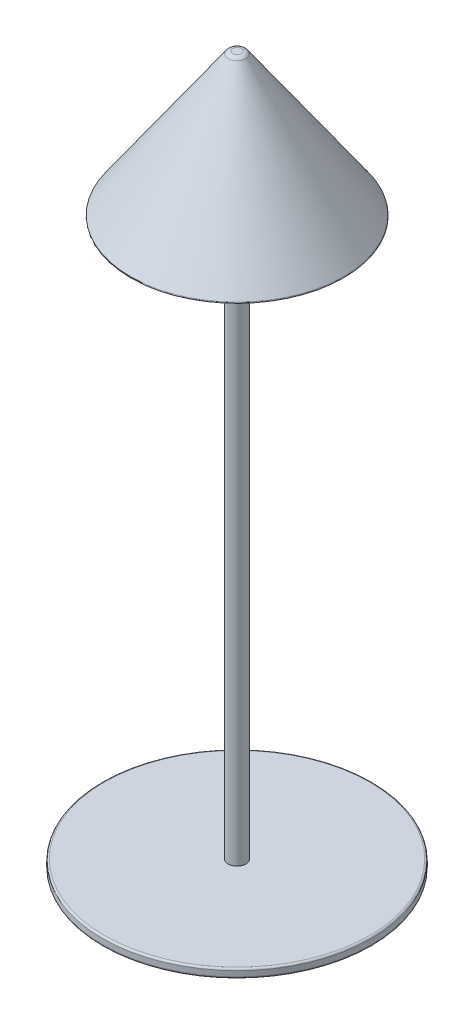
ISO-10303-21;
HEADER;
FILE_DESCRIPTION(('STEP AP214'),'2;1');
FILE_NAME('part.step','',(''),(''),'','','');
FILE_SCHEMA(('AUTOMOTIVE_DESIGN { 1 0 10303 214 1 1 1 1 }'));
ENDSEC;
DATA;
#1=APPLICATION_CONTEXT('core data for automotive mechanical design processes');
#2=APPLICATION_PROTOCOL_DEFINITION('international standard','automotive_design',2000,#1);
#3=PRODUCT_CONTEXT('',#1,'mechanical');
#4=PRODUCT('Part','Part','',(#3));
#5=PRODUCT_RELATED_PRODUCT_CATEGORY('part','',(#4));
#6=PRODUCT_DEFINITION_FORMATION('','',#4);
#7=PRODUCT_DEFINITION_CONTEXT('part definition',#1,'design');
#8=PRODUCT_DEFINITION('design','',#6,#7);
#9=PRODUCT_DEFINITION_SHAPE('','',#8);
#10=(LENGTH_UNIT() NAMED_UNIT(*) SI_UNIT(.MILLI.,.METRE.));
#11=(NAMED_UNIT(*) PLANE_ANGLE_UNIT() SI_UNIT($,.RADIAN.));
#12=(NAMED_UNIT(*) SI_UNIT($,.STERADIAN.) SOLID_ANGLE_UNIT());
#13=UNCERTAINTY_MEASURE_WITH_UNIT(LENGTH_MEASURE(1.E-05),#10,'distance_accuracy_value','');
#14=(GEOMETRIC_REPRESENTATION_CONTEXT(3) GLOBAL_UNCERTAINTY_ASSIGNED_CONTEXT((#13)) GLOBAL_UNIT_ASSIGNED_CONTEXT((#10,
#11,#12)) REPRESENTATION_CONTEXT('',''));
#15=CARTESIAN_POINT('',(0.,0.,0.));
#16=DIRECTION('',(0.,0.,1.));
#17=DIRECTION('',(1.,0.,0.));
#18=AXIS2_PLACEMENT_3D('',#15,#16,#17);
#19=CARTESIAN_POINT('',(-14.1843345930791,258.158097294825,320.));
#20=DIRECTION('',(0.,-1.,0.));
#21=DIRECTION('',(0.998534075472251,0.,-0.0541267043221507));
#22=AXIS2_PLACEMENT_3D('',#19,#20,#21);
#23=PLANE('',#22);
#24=CARTESIAN_POINT('',(-14.1843345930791,258.158097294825,320.));
#25=DIRECTION('',(0.,-1.,0.));
#26=DIRECTION('',(0.998534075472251,0.,-0.0541267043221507));
#27=AXIS2_PLACEMENT_3D('',#24,#25,#26);
#28=CIRCLE('',#27,2.4380333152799);
#29=CARTESIAN_POINT('',(-11.7498752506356,258.158097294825,319.868037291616));
#30=VERTEX_POINT('',#29);
#31=EDGE_CURVE('P0_E30',#30,#30,#28,.F.);
#32=ORIENTED_EDGE('',*,*,#31,.T.);
#33=EDGE_LOOP('',(#32));
#34=FACE_BOUND('',#33,.T.);
#35=ADVANCED_FACE('P0_F15',(#34),#23,.F.);
#36=CARTESIAN_POINT('',(-14.1843345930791,178.158097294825,320.));
#37=DIRECTION('',(0.,-1.,0.));
#38=DIRECTION('',(0.998534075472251,0.,-0.0541267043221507));
#39=AXIS2_PLACEMENT_3D('',#36,#37,#38);
#40=CONICAL_SURFACE('',#39,60.,0.610725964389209);
#41=CARTESIAN_POINT('',(-14.1843345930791,178.944828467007,320.));
#42=DIRECTION('',(0.,1.,0.));
#43=DIRECTION('',(-0.998534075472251,0.,0.0541267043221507));
#44=AXIS2_PLACEMENT_3D('',#41,#42,#43);
#45=CIRCLE('',#44,59.4492881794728);
#46=CARTESIAN_POINT('',(45.1778054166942,178.944828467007,316.782205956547));
#47=VERTEX_POINT('',#46);
#48=EDGE_CURVE('P0_E22',#47,#47,#45,.T.);
#49=CARTESIAN_POINT('',(-14.1843345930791,256.878484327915,320.));
#50=DIRECTION('',(0.,1.,0.));
#51=DIRECTION('',(-0.998534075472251,0.,0.0541267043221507));
#52=AXIS2_PLACEMENT_3D('',#49,#50,#51);
#53=CIRCLE('',#52,4.89572907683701);
#54=CARTESIAN_POINT('',(-9.29578228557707,256.878484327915,319.735010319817));
#55=VERTEX_POINT('',#54);
#56=EDGE_CURVE('P0_E26',#55,#55,#53,.F.);
#57=CARTESIAN_POINT('',(45.1778054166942,178.944828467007,316.782205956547));
#58=CARTESIAN_POINT('',(44.6103722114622,179.756637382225,316.812964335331));
#59=CARTESIAN_POINT('',(44.0429390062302,180.568446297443,316.843722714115));
#60=CARTESIAN_POINT('',(42.9080725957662,182.192064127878,316.905239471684));
#61=CARTESIAN_POINT('',(42.3406393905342,183.003873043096,316.935997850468));
#62=CARTESIAN_POINT('',(41.2057729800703,184.627490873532,316.997514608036));
#63=CARTESIAN_POINT('',(40.6383397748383,185.439299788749,317.02827298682));
#64=CARTESIAN_POINT('',(39.5034733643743,187.062917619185,317.089789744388));
#65=CARTESIAN_POINT('',(38.9360401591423,187.874726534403,317.120548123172));
#66=CARTESIAN_POINT('',(37.8011737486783,189.498344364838,317.18206488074));
#67=CARTESIAN_POINT('',(37.2337405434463,190.310153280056,317.212823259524));
#68=CARTESIAN_POINT('',(36.0988741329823,191.933771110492,317.274340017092));
#69=CARTESIAN_POINT('',(35.5314409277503,192.74558002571,317.305098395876));
#70=CARTESIAN_POINT('',(34.3965745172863,194.369197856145,317.366615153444));
#71=CARTESIAN_POINT('',(33.8291413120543,195.181006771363,317.397373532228));
#72=CARTESIAN_POINT('',(32.6942749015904,196.804624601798,317.458890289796));
#73=CARTESIAN_POINT('',(32.1268416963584,197.616433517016,317.489648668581));
#74=CARTESIAN_POINT('',(30.9919752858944,199.240051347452,317.551165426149));
#75=CARTESIAN_POINT('',(30.4245420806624,200.05186026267,317.581923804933));
#76=CARTESIAN_POINT('',(29.2896756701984,201.675478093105,317.643440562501));
#77=CARTESIAN_POINT('',(28.7222424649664,202.487287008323,317.674198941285));
#78=CARTESIAN_POINT('',(27.5873760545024,204.110904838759,317.735715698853));
#79=CARTESIAN_POINT('',(27.0199428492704,204.922713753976,317.766474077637));
#80=CARTESIAN_POINT('',(25.8850764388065,206.546331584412,317.827990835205));
#81=CARTESIAN_POINT('',(25.3176432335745,207.35814049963,317.858749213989));
#82=CARTESIAN_POINT('',(24.1827768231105,208.981758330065,317.920265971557));
#83=CARTESIAN_POINT('',(23.6153436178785,209.793567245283,317.951024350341));
#84=CARTESIAN_POINT('',(22.4804772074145,211.417185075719,318.01254110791));
#85=CARTESIAN_POINT('',(21.9130440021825,212.228993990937,318.043299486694));
#86=CARTESIAN_POINT('',(20.7781775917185,213.852611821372,318.104816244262));
#87=CARTESIAN_POINT('',(20.2107443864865,214.66442073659,318.135574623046));
#88=CARTESIAN_POINT('',(19.0758779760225,216.288038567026,318.197091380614));
#89=CARTESIAN_POINT('',(18.5084447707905,217.099847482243,318.227849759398));
#90=CARTESIAN_POINT('',(17.3735783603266,218.723465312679,318.289366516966));
#91=CARTESIAN_POINT('',(16.8061451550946,219.535274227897,318.32012489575));
#92=CARTESIAN_POINT('',(15.6712787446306,221.158892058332,318.381641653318));
#93=CARTESIAN_POINT('',(15.1038455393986,221.97070097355,318.412400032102));
#94=CARTESIAN_POINT('',(13.9689791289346,223.594318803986,318.47391678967));
#95=CARTESIAN_POINT('',(13.4015459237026,224.406127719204,318.504675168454));
#96=CARTESIAN_POINT('',(12.2666795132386,226.029745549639,318.566191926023));
#97=CARTESIAN_POINT('',(11.6992463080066,226.841554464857,318.596950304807));
#98=CARTESIAN_POINT('',(10.5643798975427,228.465172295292,318.658467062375));
#99=CARTESIAN_POINT('',(9.99694669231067,229.27698121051,318.689225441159));
#100=CARTESIAN_POINT('',(8.86208028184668,230.900599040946,318.750742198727));
#101=CARTESIAN_POINT('',(8.29464707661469,231.712407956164,318.781500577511));
#102=CARTESIAN_POINT('',(7.1597806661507,233.336025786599,318.843017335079));
#103=CARTESIAN_POINT('',(6.59234746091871,234.147834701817,318.873775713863));
#104=CARTESIAN_POINT('',(5.45748105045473,235.771452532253,318.935292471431));
#105=CARTESIAN_POINT('',(4.89004784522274,236.58326144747,318.966050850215));
#106=CARTESIAN_POINT('',(3.75518143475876,238.206879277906,319.027567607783));
#107=CARTESIAN_POINT('',(3.18774822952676,239.018688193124,319.058325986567));
#108=CARTESIAN_POINT('',(2.05288181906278,240.642306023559,319.119842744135));
#109=CARTESIAN_POINT('',(1.48544861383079,241.454114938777,319.15060112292));
#110=CARTESIAN_POINT('',(0.350582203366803,243.077732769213,319.212117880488));
#111=CARTESIAN_POINT('',(-0.216851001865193,243.889541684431,319.242876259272));
#112=CARTESIAN_POINT('',(-1.35171741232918,245.513159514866,319.30439301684));
#113=CARTESIAN_POINT('',(-1.91915061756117,246.324968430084,319.335151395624));
#114=CARTESIAN_POINT('',(-3.05401702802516,247.94858626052,319.396668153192));
#115=CARTESIAN_POINT('',(-3.62145023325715,248.760395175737,319.427426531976));
#116=CARTESIAN_POINT('',(-4.75631664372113,250.384013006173,319.488943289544));
#117=CARTESIAN_POINT('',(-5.32374984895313,251.195821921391,319.519701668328));
#118=CARTESIAN_POINT('',(-6.45861625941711,252.819439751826,319.581218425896));
#119=CARTESIAN_POINT('',(-7.02604946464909,253.631248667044,319.61197680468));
#120=CARTESIAN_POINT('',(-8.16091587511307,255.25486649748,319.673493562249));
#121=CARTESIAN_POINT('',(-8.72834908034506,256.066675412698,319.704251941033));
#122=CARTESIAN_POINT('',(-9.29578228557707,256.878484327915,319.735010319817));
#123=B_SPLINE_CURVE_WITH_KNOTS('',3,(#57,#58,#59,#60,#61,#62,#63,#64,#65,#66,#67,#68,#69,#70,
#71,#72,#73,#74,#75,#76,#77,#78,#79,#80,#81,#82,#83,#84,#85,#86,#87,#88,#89,#90,#91,#92,#93,#94,
#95,#96,#97,#98,#99,#100,#101,#102,#103,#104,#105,#106,#107,#108,#109,#110,#111,#112,#113,#114,
#115,#116,#117,#118,#119,#120,#121,#122),.UNSPECIFIED.,.F.,.F.,(4,2,2,2,2,2,2,2,2,2,2,2,2,2,2,2,
2,2,2,2,2,2,2,2,2,2,2,2,2,2,2,2,4),(0.,2.97281720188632,5.94563440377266,8.918451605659,
11.8912688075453,14.8640860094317,17.836903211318,20.8097204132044,23.7825376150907,
26.755354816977,29.7281720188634,32.7009892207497,35.6738064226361,38.6466236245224,
41.6194408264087,44.5922580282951,47.5650752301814,50.5378924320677,53.5107096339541,
56.4835268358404,59.4563440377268,62.4291612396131,65.4019784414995,68.3747956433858,
71.3476128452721,74.3204300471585,77.2932472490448,80.2660644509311,83.2388816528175,
86.2116988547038,89.1845160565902,92.1573332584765,95.1301504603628),.UNSPECIFIED.);
#124=EDGE_CURVE('P0_BSEAM56',#47,#55,#123,.T.);
#125=ORIENTED_EDGE('',*,*,#48,.T.);
#126=ORIENTED_EDGE('',*,*,#56,.T.);
#127=ORIENTED_EDGE('',*,*,#124,.T.);
#128=ORIENTED_EDGE('',*,*,#124,.F.);
#129=EDGE_LOOP('',(#125,#127,#126,#128));
#130=FACE_BOUND('',#129,.T.);
#131=ADVANCED_FACE('P0_F56',(#130),#40,.T.);
#132=CARTESIAN_POINT('',(-17.4319368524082,178.158097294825,260.087955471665));
#133=DIRECTION('',(0.,1.,0.));
#134=DIRECTION('',(-0.998534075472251,0.,0.0541267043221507));
#135=AXIS2_PLACEMENT_3D('',#132,#133,#134);
#136=PLANE('',#135);
#137=CARTESIAN_POINT('',(-14.1843345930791,178.158097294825,320.));
#138=DIRECTION('',(0.,1.,0.));
#139=DIRECTION('',(-0.998534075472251,0.,0.0541267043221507));
#140=AXIS2_PLACEMENT_3D('',#137,#138,#139);
#141=CIRCLE('',#140,59.0396722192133);
#142=CARTESIAN_POINT('',(-73.137459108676,178.158097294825,323.195622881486));
#143=VERTEX_POINT('',#142);
#144=EDGE_CURVE('P0_E10',#143,#143,#141,.F.);
#145=ORIENTED_EDGE('',*,*,#144,.T.);
#146=EDGE_LOOP('',(#145));
#147=FACE_BOUND('',#146,.T.);
#148=CARTESIAN_POINT('',(-14.1843345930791,178.158097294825,320.));
#149=DIRECTION('',(0.,1.,0.));
#150=DIRECTION('',(-0.998534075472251,0.,0.0541267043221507));
#151=AXIS2_PLACEMENT_3D('',#148,#149,#150);
#152=CIRCLE('',#151,57.5586888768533);
#153=CARTESIAN_POINT('',(43.2899775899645,178.158097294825,316.884537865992));
#154=VERTEX_POINT('',#153);
#155=EDGE_CURVE('P0_E36',#154,#154,#152,.T.);
#156=ORIENTED_EDGE('',*,*,#155,.T.);
#157=EDGE_LOOP('',(#156));
#158=FACE_BOUND('',#157,.T.);
#159=ADVANCED_FACE('P0_F47',(#147,#158),#136,.F.);
#160=CARTESIAN_POINT('',(-14.1843345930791,256.158097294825,320.));
#161=DIRECTION('',(0.,-1.,0.));
#162=DIRECTION('',(0.998534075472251,0.,-0.0541267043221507));
#163=AXIS2_PLACEMENT_3D('',#160,#161,#162);
#164=PLANE('',#163);
#165=CARTESIAN_POINT('',(-14.1843345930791,256.158097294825,320.));
#166=DIRECTION('',(0.,-1.,0.));
#167=DIRECTION('',(0.998534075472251,0.,-0.0541267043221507));
#168=AXIS2_PLACEMENT_3D('',#165,#166,#167);
#169=CIRCLE('',#168,2.95868887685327);
#170=CARTESIAN_POINT('',(-11.2299829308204,256.158097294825,319.839855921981));
#171=VERTEX_POINT('',#170);
#172=EDGE_CURVE('P0_E35',#171,#171,#169,.F.);
#173=ORIENTED_EDGE('',*,*,#172,.F.);
#174=EDGE_LOOP('',(#173));
#175=FACE_BOUND('',#174,.T.);
#176=ADVANCED_FACE('P0_F45',(#175),#164,.T.);
#177=CARTESIAN_POINT('',(-14.1843345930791,177.011172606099,320.));
#178=DIRECTION('',(0.,-1.,0.));
#179=DIRECTION('',(0.998534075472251,0.,-0.0541267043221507));
#180=AXIS2_PLACEMENT_3D('',#177,#178,#179);
#181=CONICAL_SURFACE('',#180,58.3615361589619,0.610725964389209);
#182=CARTESIAN_POINT('',(-11.2299829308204,256.158097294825,319.839855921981));
#183=CARTESIAN_POINT('',(-10.6620666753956,255.345597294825,319.809071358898));
#184=CARTESIAN_POINT('',(-10.0941504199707,254.533097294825,319.778286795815));
#185=CARTESIAN_POINT('',(-8.95831790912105,252.908097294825,319.716717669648));
#186=CARTESIAN_POINT('',(-8.3904016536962,252.095597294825,319.685933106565));
#187=CARTESIAN_POINT('',(-7.25456914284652,250.470597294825,319.624363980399));
#188=CARTESIAN_POINT('',(-6.68665288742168,249.658097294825,319.593579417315));
#189=CARTESIAN_POINT('',(-5.55082037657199,248.033097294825,319.532010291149));
#190=CARTESIAN_POINT('',(-4.98290412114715,247.220597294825,319.501225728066));
#191=CARTESIAN_POINT('',(-3.84707161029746,245.595597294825,319.439656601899));
#192=CARTESIAN_POINT('',(-3.27915535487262,244.783097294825,319.408872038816));
#193=CARTESIAN_POINT('',(-2.14332284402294,243.158097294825,319.34730291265));
#194=CARTESIAN_POINT('',(-1.57540658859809,242.345597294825,319.316518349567));
#195=CARTESIAN_POINT('',(-0.439574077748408,240.720597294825,319.2549492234));
#196=CARTESIAN_POINT('',(0.128342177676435,239.908097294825,319.224164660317));
#197=CARTESIAN_POINT('',(1.26417468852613,238.283097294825,319.16259553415));
#198=CARTESIAN_POINT('',(1.83209094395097,237.470597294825,319.131810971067));
#199=CARTESIAN_POINT('',(2.96792345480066,235.845597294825,319.070241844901));
#200=CARTESIAN_POINT('',(3.5358397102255,235.033097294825,319.039457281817));
#201=CARTESIAN_POINT('',(4.67167222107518,233.408097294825,318.977888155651));
#202=CARTESIAN_POINT('',(5.23958847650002,232.595597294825,318.947103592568));
#203=CARTESIAN_POINT('',(6.37542098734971,230.970597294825,318.885534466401));
#204=CARTESIAN_POINT('',(6.94333724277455,230.158097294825,318.854749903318));
#205=CARTESIAN_POINT('',(8.07916975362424,228.533097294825,318.793180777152));
#206=CARTESIAN_POINT('',(8.64708600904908,227.720597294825,318.762396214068));
#207=CARTESIAN_POINT('',(9.78291851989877,226.095597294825,318.700827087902));
#208=CARTESIAN_POINT('',(10.3508347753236,225.283097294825,318.670042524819));
#209=CARTESIAN_POINT('',(11.4866672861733,223.658097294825,318.608473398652));
#210=CARTESIAN_POINT('',(12.0545835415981,222.845597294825,318.577688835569));
#211=CARTESIAN_POINT('',(13.1904160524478,221.220597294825,318.516119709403));
#212=CARTESIAN_POINT('',(13.7583323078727,220.408097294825,318.485335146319));
#213=CARTESIAN_POINT('',(14.8941648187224,218.783097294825,318.423766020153));
#214=CARTESIAN_POINT('',(15.4620810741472,217.970597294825,318.39298145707));
#215=CARTESIAN_POINT('',(16.5979135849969,216.345597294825,318.331412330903));
#216=CARTESIAN_POINT('',(17.1658298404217,215.533097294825,318.30062776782));
#217=CARTESIAN_POINT('',(18.3016623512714,213.908097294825,318.239058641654));
#218=CARTESIAN_POINT('',(18.8695786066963,213.095597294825,318.20827407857));
#219=CARTESIAN_POINT('',(20.0054111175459,211.470597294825,318.146704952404));
#220=CARTESIAN_POINT('',(20.5733273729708,210.658097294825,318.115920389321));
#221=CARTESIAN_POINT('',(21.7091598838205,209.033097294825,318.054351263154));
#222=CARTESIAN_POINT('',(22.2770761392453,208.220597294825,318.023566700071));
#223=CARTESIAN_POINT('',(23.412908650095,206.595597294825,317.961997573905));
#224=CARTESIAN_POINT('',(23.9808249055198,205.783097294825,317.931213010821));
#225=CARTESIAN_POINT('',(25.1166574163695,204.158097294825,317.869643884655));
#226=CARTESIAN_POINT('',(25.6845736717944,203.345597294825,317.838859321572));
#227=CARTESIAN_POINT('',(26.8204061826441,201.720597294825,317.777290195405));
#228=CARTESIAN_POINT('',(27.3883224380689,200.908097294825,317.746505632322));
#229=CARTESIAN_POINT('',(28.5241549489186,199.283097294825,317.684936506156));
#230=CARTESIAN_POINT('',(29.0920712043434,198.470597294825,317.654151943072));
#231=CARTESIAN_POINT('',(30.2279037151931,196.845597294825,317.592582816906));
#232=CARTESIAN_POINT('',(30.795819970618,196.033097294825,317.561798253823));
#233=CARTESIAN_POINT('',(31.9316524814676,194.408097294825,317.500229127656));
#234=CARTESIAN_POINT('',(32.4995687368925,193.595597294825,317.469444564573));
#235=CARTESIAN_POINT('',(33.6354012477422,191.970597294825,317.407875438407));
#236=CARTESIAN_POINT('',(34.203317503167,191.158097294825,317.377090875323));
#237=CARTESIAN_POINT('',(35.3391500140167,189.533097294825,317.315521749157));
#238=CARTESIAN_POINT('',(35.9070662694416,188.720597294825,317.284737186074));
#239=CARTESIAN_POINT('',(37.0428987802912,187.095597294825,317.223168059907));
#240=CARTESIAN_POINT('',(37.6108150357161,186.283097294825,317.192383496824));
#241=CARTESIAN_POINT('',(38.7466475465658,184.658097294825,317.130814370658));
#242=CARTESIAN_POINT('',(39.3145638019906,183.845597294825,317.100029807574));
#243=CARTESIAN_POINT('',(40.4503963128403,182.220597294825,317.038460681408));
#244=CARTESIAN_POINT('',(41.0183125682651,181.408097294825,317.007676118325));
#245=CARTESIAN_POINT('',(42.1541450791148,179.783097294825,316.946106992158));
#246=CARTESIAN_POINT('',(42.7220613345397,178.970597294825,316.915322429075));
#247=CARTESIAN_POINT('',(43.2899775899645,178.158097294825,316.884537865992));
#248=B_SPLINE_CURVE_WITH_KNOTS('',3,(#182,#183,#184,#185,#186,#187,#188,#189,#190,#191,#192,
#193,#194,#195,#196,#197,#198,#199,#200,#201,#202,#203,#204,#205,#206,#207,#208,#209,#210,#211,
#212,#213,#214,#215,#216,#217,#218,#219,#220,#221,#222,#223,#224,#225,#226,#227,#228,#229,#230,
#231,#232,#233,#234,#235,#236,#237,#238,#239,#240,#241,#242,#243,#244,#245,#246,#247),
.UNSPECIFIED.,.F.,.F.,(4,2,2,2,2,2,2,2,2,2,2,2,2,2,2,2,2,2,2,2,2,2,2,2,2,2,2,2,2,2,2,2,4),(0.,
2.97534793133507,5.95069586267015,8.92604379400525,11.9013917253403,14.8767396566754,
17.8520875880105,20.8274355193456,23.8027834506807,26.7781313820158,29.7534793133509,
32.728827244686,35.7041751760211,38.6795231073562,41.6548710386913,44.6302189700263,
47.6055669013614,50.5809148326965,53.5562627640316,56.5316106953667,59.5069586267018,
62.4823065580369,65.457654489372,68.4330024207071,71.4083503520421,74.3836982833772,
77.3590462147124,80.3343941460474,83.3097420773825,86.2850900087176,89.2604379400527,
92.2357858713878,95.2111338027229),.UNSPECIFIED.);
#249=EDGE_CURVE('P0_BSEAM42',#171,#154,#248,.T.);
#250=ORIENTED_EDGE('',*,*,#172,.T.);
#251=ORIENTED_EDGE('',*,*,#155,.F.);
#252=ORIENTED_EDGE('',*,*,#249,.T.);
#253=ORIENTED_EDGE('',*,*,#249,.F.);
#254=EDGE_LOOP('',(#250,#252,#251,#253));
#255=FACE_BOUND('',#254,.T.);
#256=ADVANCED_FACE('P0_F42',(#255),#181,.F.);
#257=CARTESIAN_POINT('',(-14.1843345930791,255.158097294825,320.));
#258=DIRECTION('',(0.,-1.,0.));
#259=DIRECTION('',(0.998534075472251,0.,-0.0541267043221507));
#260=AXIS2_PLACEMENT_3D('',#257,#258,#259);
#261=DEGENERATE_TOROIDAL_SURFACE('',#260,2.4380333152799,3.,.T.);
#262=ORIENTED_EDGE('',*,*,#56,.F.);
#263=EDGE_LOOP('',(#262));
#264=FACE_BOUND('',#263,.T.);
#265=ORIENTED_EDGE('',*,*,#31,.F.);
#266=EDGE_LOOP('',(#265));
#267=FACE_BOUND('',#266,.T.);
#268=ADVANCED_FACE('P0_F54',(#264,#267),#261,.T.);
#269=CARTESIAN_POINT('',(-14.1843345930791,178.658097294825,320.));
#270=DIRECTION('',(0.,1.,0.));
#271=DIRECTION('',(-0.998534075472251,0.,0.0541267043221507));
#272=AXIS2_PLACEMENT_3D('',#269,#270,#271);
#273=TOROIDAL_SURFACE('',#272,59.0396722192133,0.5);
#274=ORIENTED_EDGE('',*,*,#144,.F.);
#275=EDGE_LOOP('',(#274));
#276=FACE_BOUND('',#275,.T.);
#277=ORIENTED_EDGE('',*,*,#48,.F.);
#278=EDGE_LOOP('',(#277));
#279=FACE_BOUND('',#278,.T.);
#280=ADVANCED_FACE('P0_F17',(#276,#279),#273,.T.);
#281=CLOSED_SHELL('',(#35,#131,#159,#176,#256,#268,#280));
#282=MANIFOLD_SOLID_BREP('P0_B1',#281);
#283=CARTESIAN_POINT('',(-14.1843345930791,188.658097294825,320.));
#284=DIRECTION('',(0.,1.,0.));
#285=DIRECTION('',(0.0541267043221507,0.,0.998534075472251));
#286=AXIS2_PLACEMENT_3D('',#283,#284,#285);
#287=PLANE('',#286);
#288=CARTESIAN_POINT('',(-14.1843345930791,188.658097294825,320.));
#289=DIRECTION('',(0.,1.,0.));
#290=DIRECTION('',(0.0541267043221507,0.,0.998534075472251));
#291=AXIS2_PLACEMENT_3D('',#288,#289,#290);
#292=CIRCLE('',#291,50.3735945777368);
#293=CARTESIAN_POINT('',(-11.4577779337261,188.658097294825,370.299750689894));
#294=VERTEX_POINT('',#293);
#295=EDGE_CURVE('P1_E10',#294,#294,#292,.T.);
#296=ORIENTED_EDGE('',*,*,#295,.T.);
#297=EDGE_LOOP('',(#296));
#298=FACE_BOUND('',#297,.T.);
#299=ADVANCED_FACE('P1_F15',(#298),#287,.T.);
#300=CARTESIAN_POINT('',(-14.1843345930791,188.658097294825,320.));
#301=DIRECTION('',(0.,-1.,0.));
#302=DIRECTION('',(-0.0541267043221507,0.,-0.998534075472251));
#303=AXIS2_PLACEMENT_3D('',#300,#301,#302);
#304=CONICAL_SURFACE('',#303,50.3735945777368,0.718829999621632);
#305=CARTESIAN_POINT('',(-14.1843345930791,188.158097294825,320.));
#306=DIRECTION('',(0.,1.,0.));
#307=DIRECTION('',(0.0541267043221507,0.,0.998534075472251));
#308=AXIS2_PLACEMENT_3D('',#305,#306,#307);
#309=CIRCLE('',#308,50.8110945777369);
#310=CARTESIAN_POINT('',(-11.4340975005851,188.158097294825,370.736609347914));
#311=VERTEX_POINT('',#310);
#312=EDGE_CURVE('P1_E21',#311,#311,#309,.T.);
#313=ORIENTED_EDGE('',*,*,#312,.T.);
#314=EDGE_LOOP('',(#313));
#315=FACE_BOUND('',#314,.T.);
#316=ORIENTED_EDGE('',*,*,#295,.F.);
#317=EDGE_LOOP('',(#316));
#318=FACE_BOUND('',#317,.T.);
#319=ADVANCED_FACE('P1_F27',(#315,#318),#304,.T.);
#320=CARTESIAN_POINT('',(-14.1843345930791,188.158097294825,320.));
#321=DIRECTION('',(0.,-1.,0.));
#322=DIRECTION('',(-0.0541267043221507,0.,-0.998534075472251));
#323=AXIS2_PLACEMENT_3D('',#320,#321,#322);
#324=PLANE('',#323);
#325=ORIENTED_EDGE('',*,*,#312,.F.);
#326=EDGE_LOOP('',(#325));
#327=FACE_BOUND('',#326,.T.);
#328=ADVANCED_FACE('P1_F30',(#327),#324,.T.);
#329=CLOSED_SHELL('',(#299,#319,#328));
#330=MANIFOLD_SOLID_BREP('P1_B1',#329);
#331=CARTESIAN_POINT('',(-14.1843345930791,168.158097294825,320.));
#332=DIRECTION('',(0.,1.,0.));
#333=DIRECTION('',(-0.998534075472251,0.,0.0541267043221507));
#334=AXIS2_PLACEMENT_3D('',#331,#332,#333);
#335=CYLINDRICAL_SURFACE('',#334,5.);
#336=CARTESIAN_POINT('',(-14.1843345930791,168.158097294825,320.));
#337=DIRECTION('',(0.,-1.,0.));
#338=DIRECTION('',(0.998534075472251,0.,-0.0541267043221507));
#339=AXIS2_PLACEMENT_3D('',#336,#337,#338);
#340=CIRCLE('',#339,5.);
#341=CARTESIAN_POINT('',(-9.19166421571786,168.158097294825,319.729366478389));
#342=VERTEX_POINT('',#341);
#343=EDGE_CURVE('P2_E9',#342,#342,#340,.T.);
#344=ORIENTED_EDGE('',*,*,#343,.F.);
#345=EDGE_LOOP('',(#344));
#346=FACE_BOUND('',#345,.T.);
#347=CARTESIAN_POINT('',(-14.1843345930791,188.158097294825,320.));
#348=DIRECTION('',(0.,-1.,0.));
#349=DIRECTION('',(0.998534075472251,0.,-0.0541267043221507));
#350=AXIS2_PLACEMENT_3D('',#347,#348,#349);
#351=CIRCLE('',#350,5.);
#352=CARTESIAN_POINT('',(-9.19166421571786,188.158097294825,319.729366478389));
#353=VERTEX_POINT('',#352);
#354=EDGE_CURVE('P2_E17',#353,#353,#351,.T.);
#355=ORIENTED_EDGE('',*,*,#354,.T.);
#356=EDGE_LOOP('',(#355));
#357=FACE_BOUND('',#356,.T.);
#358=ADVANCED_FACE('P2_F14',(#346,#357),#335,.T.);
#359=CARTESIAN_POINT('',(-14.1843345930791,168.158097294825,320.));
#360=DIRECTION('',(0.,-1.,0.));
#361=DIRECTION('',(0.998534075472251,0.,-0.0541267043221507));
#362=AXIS2_PLACEMENT_3D('',#359,#360,#361);
#363=PLANE('',#362);
#364=CARTESIAN_POINT('',(-14.1843345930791,168.158097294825,320.));
#365=DIRECTION('',(0.,-1.,0.));
#366=DIRECTION('',(0.998534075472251,0.,-0.0541267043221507));
#367=AXIS2_PLACEMENT_3D('',#364,#365,#366);
#368=CIRCLE('',#367,4.);
#369=CARTESIAN_POINT('',(-10.1901982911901,168.158097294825,319.783493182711));
#370=VERTEX_POINT('',#369);
#371=EDGE_CURVE('P2_E26',#370,#370,#368,.T.);
#372=ORIENTED_EDGE('',*,*,#371,.F.);
#373=EDGE_LOOP('',(#372));
#374=FACE_BOUND('',#373,.T.);
#375=ORIENTED_EDGE('',*,*,#343,.T.);
#376=EDGE_LOOP('',(#375));
#377=FACE_BOUND('',#376,.T.);
#378=ADVANCED_FACE('P2_F41',(#374,#377),#363,.T.);
#379=CARTESIAN_POINT('',(-14.1843345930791,188.158097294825,320.));
#380=DIRECTION('',(0.,-1.,0.));
#381=DIRECTION('',(0.998534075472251,0.,-0.0541267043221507));
#382=AXIS2_PLACEMENT_3D('',#379,#380,#381);
#383=PLANE('',#382);
#384=ORIENTED_EDGE('',*,*,#354,.F.);
#385=EDGE_LOOP('',(#384));
#386=FACE_BOUND('',#385,.T.);
#387=ADVANCED_FACE('P2_F37',(#386),#383,.F.);
#388=CARTESIAN_POINT('',(-14.1843345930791,178.158097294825,320.));
#389=DIRECTION('',(0.,-1.,0.));
#390=DIRECTION('',(0.998534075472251,0.,-0.0541267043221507));
#391=AXIS2_PLACEMENT_3D('',#388,#389,#390);
#392=CYLINDRICAL_SURFACE('',#391,4.);
#393=CARTESIAN_POINT('',(-14.1843345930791,178.158097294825,320.));
#394=DIRECTION('',(0.,-1.,0.));
#395=DIRECTION('',(0.998534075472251,0.,-0.0541267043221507));
#396=AXIS2_PLACEMENT_3D('',#393,#394,#395);
#397=CIRCLE('',#396,4.);
#398=CARTESIAN_POINT('',(-10.1901982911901,178.158097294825,319.783493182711));
#399=VERTEX_POINT('',#398);
#400=EDGE_CURVE('P2_E24',#399,#399,#397,.T.);
#401=ORIENTED_EDGE('',*,*,#400,.F.);
#402=EDGE_LOOP('',(#401));
#403=FACE_BOUND('',#402,.T.);
#404=ORIENTED_EDGE('',*,*,#371,.T.);
#405=EDGE_LOOP('',(#404));
#406=FACE_BOUND('',#405,.T.);
#407=ADVANCED_FACE('P2_F34',(#403,#406),#392,.F.);
#408=CARTESIAN_POINT('',(-14.1843345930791,178.158097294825,320.));
#409=DIRECTION('',(0.,-1.,0.));
#410=DIRECTION('',(0.998534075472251,0.,-0.0541267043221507));
#411=AXIS2_PLACEMENT_3D('',#408,#409,#410);
#412=PLANE('',#411);
#413=ORIENTED_EDGE('',*,*,#400,.T.);
#414=EDGE_LOOP('',(#413));
#415=FACE_BOUND('',#414,.T.);
#416=ADVANCED_FACE('P2_F32',(#415),#412,.T.);
#417=CLOSED_SHELL('',(#358,#378,#387,#407,#416));
#418=MANIFOLD_SOLID_BREP('P2_B1',#417);
#419=CARTESIAN_POINT('',(-14.1843345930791,168.158097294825,320.));
#420=DIRECTION('',(0.,-1.,0.));
#421=DIRECTION('',(0.,0.,-1.));
#422=AXIS2_PLACEMENT_3D('',#419,#420,#421);
#423=CYLINDRICAL_SURFACE('',#422,5.);
#424=CARTESIAN_POINT('',(-14.1843345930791,168.158097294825,320.));
#425=DIRECTION('',(0.,1.,0.));
#426=DIRECTION('',(0.,0.,1.));
#427=AXIS2_PLACEMENT_3D('',#424,#425,#426);
#428=CIRCLE('',#427,5.);
#429=CARTESIAN_POINT('',(-14.1843345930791,168.158097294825,325.));
#430=VERTEX_POINT('',#429);
#431=EDGE_CURVE('P3_E10',#430,#430,#428,.T.);
#432=ORIENTED_EDGE('',*,*,#431,.F.);
#433=EDGE_LOOP('',(#432));
#434=FACE_BOUND('',#433,.T.);
#435=CARTESIAN_POINT('',(-14.1843345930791,-131.841902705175,320.));
#436=DIRECTION('',(0.,1.,0.));
#437=DIRECTION('',(0.,0.,1.));
#438=AXIS2_PLACEMENT_3D('',#435,#436,#437);
#439=CIRCLE('',#438,5.);
#440=CARTESIAN_POINT('',(-14.1843345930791,-131.841902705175,325.));
#441=VERTEX_POINT('',#440);
#442=EDGE_CURVE('P3_E18',#441,#441,#439,.T.);
#443=ORIENTED_EDGE('',*,*,#442,.T.);
#444=EDGE_LOOP('',(#443));
#445=FACE_BOUND('',#444,.T.);
#446=ADVANCED_FACE('P3_F15',(#434,#445),#423,.T.);
#447=CARTESIAN_POINT('',(-14.1843345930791,168.158097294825,320.));
#448=DIRECTION('',(0.,1.,0.));
#449=DIRECTION('',(0.,0.,1.));
#450=AXIS2_PLACEMENT_3D('',#447,#448,#449);
#451=PLANE('',#450);
#452=ORIENTED_EDGE('',*,*,#431,.T.);
#453=EDGE_LOOP('',(#452));
#454=FACE_BOUND('',#453,.T.);
#455=ADVANCED_FACE('P3_F30',(#454),#451,.T.);
#456=CARTESIAN_POINT('',(-14.1843345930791,-131.841902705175,320.));
#457=DIRECTION('',(0.,1.,0.));
#458=DIRECTION('',(0.,0.,1.));
#459=AXIS2_PLACEMENT_3D('',#456,#457,#458);
#460=PLANE('',#459);
#461=ORIENTED_EDGE('',*,*,#442,.F.);
#462=EDGE_LOOP('',(#461));
#463=FACE_BOUND('',#462,.T.);
#464=ADVANCED_FACE('P3_F28',(#463),#460,.F.);
#465=CLOSED_SHELL('',(#446,#455,#464));
#466=MANIFOLD_SOLID_BREP('P3_B1',#465);
#467=CARTESIAN_POINT('',(-14.1843345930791,-131.841902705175,320.));
#468=DIRECTION('',(0.,-1.,0.));
#469=DIRECTION('',(0.,0.,-1.));
#470=AXIS2_PLACEMENT_3D('',#467,#468,#469);
#471=CYLINDRICAL_SURFACE('',#470,75.);
#472=CARTESIAN_POINT('',(-14.1843345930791,-135.841902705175,320.));
#473=DIRECTION('',(0.,1.,0.));
#474=DIRECTION('',(0.,0.,1.));
#475=AXIS2_PLACEMENT_3D('',#472,#473,#474);
#476=CIRCLE('',#475,75.);
#477=CARTESIAN_POINT('',(-14.1843345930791,-135.841902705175,395.));
#478=VERTEX_POINT('',#477);
#479=EDGE_CURVE('P4_E26',#478,#478,#476,.T.);
#480=ORIENTED_EDGE('',*,*,#479,.T.);
#481=EDGE_LOOP('',(#480));
#482=FACE_BOUND('',#481,.T.);
#483=CARTESIAN_POINT('',(-14.1843345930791,-132.841902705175,320.));
#484=DIRECTION('',(0.,1.,0.));
#485=DIRECTION('',(0.,0.,1.));
#486=AXIS2_PLACEMENT_3D('',#483,#484,#485);
#487=CIRCLE('',#486,75.);
#488=CARTESIAN_POINT('',(-14.1843345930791,-132.841902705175,395.));
#489=VERTEX_POINT('',#488);
#490=EDGE_CURVE('P4_E30',#489,#489,#487,.F.);
#491=ORIENTED_EDGE('',*,*,#490,.T.);
#492=EDGE_LOOP('',(#491));
#493=FACE_BOUND('',#492,.T.);
#494=ADVANCED_FACE('P4_F15',(#482,#493),#471,.T.);
#495=CARTESIAN_POINT('',(-14.1843345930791,-131.841902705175,320.));
#496=DIRECTION('',(0.,1.,0.));
#497=DIRECTION('',(0.,0.,1.));
#498=AXIS2_PLACEMENT_3D('',#495,#496,#497);
#499=PLANE('',#498);
#500=CARTESIAN_POINT('',(-14.1843345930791,-131.841902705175,320.));
#501=DIRECTION('',(0.,1.,0.));
#502=DIRECTION('',(0.,0.,1.));
#503=AXIS2_PLACEMENT_3D('',#500,#501,#502);
#504=CIRCLE('',#503,74.);
#505=CARTESIAN_POINT('',(-14.1843345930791,-131.841902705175,394.));
#506=VERTEX_POINT('',#505);
#507=EDGE_CURVE('P4_E10',#506,#506,#504,.T.);
#508=ORIENTED_EDGE('',*,*,#507,.T.);
#509=EDGE_LOOP('',(#508));
#510=FACE_BOUND('',#509,.T.);
#511=ADVANCED_FACE('P4_F47',(#510),#499,.T.);
#512=CARTESIAN_POINT('',(-14.1843345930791,-136.841902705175,320.));
#513=DIRECTION('',(0.,1.,0.));
#514=DIRECTION('',(0.,0.,1.));
#515=AXIS2_PLACEMENT_3D('',#512,#513,#514);
#516=PLANE('',#515);
#517=CARTESIAN_POINT('',(-14.1843345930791,-136.841902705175,320.));
#518=DIRECTION('',(0.,1.,0.));
#519=DIRECTION('',(0.,0.,1.));
#520=AXIS2_PLACEMENT_3D('',#517,#518,#519);
#521=CIRCLE('',#520,74.);
#522=CARTESIAN_POINT('',(-14.1843345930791,-136.841902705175,394.));
#523=VERTEX_POINT('',#522);
#524=EDGE_CURVE('P4_E22',#523,#523,#521,.F.);
#525=ORIENTED_EDGE('',*,*,#524,.T.);
#526=EDGE_LOOP('',(#525));
#527=FACE_BOUND('',#526,.T.);
#528=ADVANCED_FACE('P4_F44',(#527),#516,.F.);
#529=CARTESIAN_POINT('',(-14.1843345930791,-135.841902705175,320.));
#530=DIRECTION('',(0.,1.,0.));
#531=DIRECTION('',(0.,0.,1.));
#532=AXIS2_PLACEMENT_3D('',#529,#530,#531);
#533=TOROIDAL_SURFACE('',#532,74.,1.);
#534=ORIENTED_EDGE('',*,*,#524,.F.);
#535=EDGE_LOOP('',(#534));
#536=FACE_BOUND('',#535,.T.);
#537=ORIENTED_EDGE('',*,*,#479,.F.);
#538=EDGE_LOOP('',(#537));
#539=FACE_BOUND('',#538,.T.);
#540=ADVANCED_FACE('P4_F39',(#536,#539),#533,.T.);
#541=CARTESIAN_POINT('',(-14.1843345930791,-132.841902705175,320.));
#542=DIRECTION('',(0.,1.,0.));
#543=DIRECTION('',(0.,0.,1.));
#544=AXIS2_PLACEMENT_3D('',#541,#542,#543);
#545=TOROIDAL_SURFACE('',#544,74.,1.);
#546=ORIENTED_EDGE('',*,*,#490,.F.);
#547=EDGE_LOOP('',(#546));
#548=FACE_BOUND('',#547,.T.);
#549=ORIENTED_EDGE('',*,*,#507,.F.);
#550=EDGE_LOOP('',(#549));
#551=FACE_BOUND('',#550,.T.);
#552=ADVANCED_FACE('P4_F17',(#548,#551),#545,.T.);
#553=CLOSED_SHELL('',(#494,#511,#528,#540,#552));
#554=MANIFOLD_SOLID_BREP('P4_B1',#553);
#555=ADVANCED_BREP_SHAPE_REPRESENTATION('',(#18,#282,#330,#418,#466,#554),#14);
#556=SHAPE_DEFINITION_REPRESENTATION(#9,#555);
ENDSEC;
END-ISO-10303-21;
